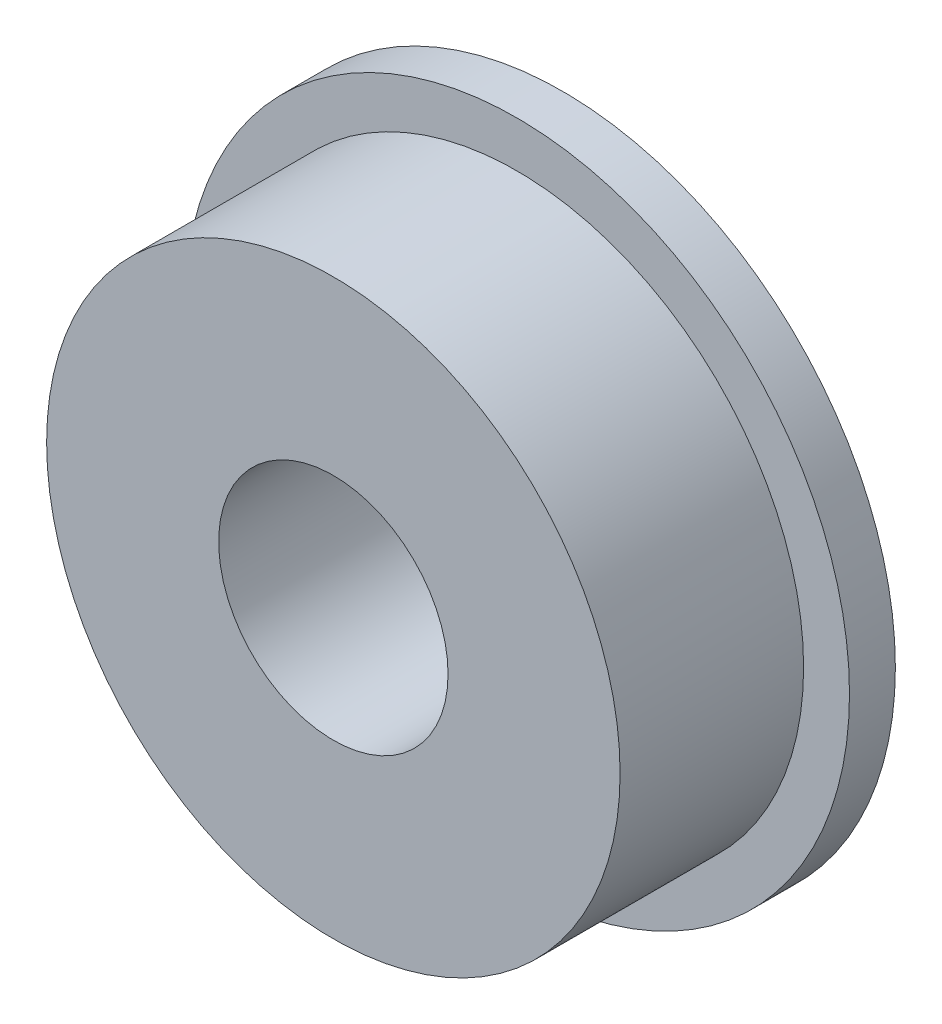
ISO-10303-21;
HEADER;
FILE_DESCRIPTION(('STEP AP214'),'2;1');
FILE_NAME('part.step','',(''),(''),'','','');
FILE_SCHEMA(('AUTOMOTIVE_DESIGN { 1 0 10303 214 1 1 1 1 }'));
ENDSEC;
DATA;
#1=APPLICATION_CONTEXT('core data for automotive mechanical design processes');
#2=APPLICATION_PROTOCOL_DEFINITION('international standard','automotive_design',2000,#1);
#3=PRODUCT_CONTEXT('',#1,'mechanical');
#4=PRODUCT('Part','Part','',(#3));
#5=PRODUCT_RELATED_PRODUCT_CATEGORY('part','',(#4));
#6=PRODUCT_DEFINITION_FORMATION('','',#4);
#7=PRODUCT_DEFINITION_CONTEXT('part definition',#1,'design');
#8=PRODUCT_DEFINITION('design','',#6,#7);
#9=PRODUCT_DEFINITION_SHAPE('','',#8);
#10=(LENGTH_UNIT() NAMED_UNIT(*) SI_UNIT(.MILLI.,.METRE.));
#11=(NAMED_UNIT(*) PLANE_ANGLE_UNIT() SI_UNIT($,.RADIAN.));
#12=(NAMED_UNIT(*) SI_UNIT($,.STERADIAN.) SOLID_ANGLE_UNIT());
#13=UNCERTAINTY_MEASURE_WITH_UNIT(LENGTH_MEASURE(1.E-05),#10,'distance_accuracy_value','');
#14=(GEOMETRIC_REPRESENTATION_CONTEXT(3) GLOBAL_UNCERTAINTY_ASSIGNED_CONTEXT((#13)) GLOBAL_UNIT_ASSIGNED_CONTEXT((#10,
#11,#12)) REPRESENTATION_CONTEXT('',''));
#15=CARTESIAN_POINT('',(0.,0.,0.));
#16=DIRECTION('',(0.,0.,1.));
#17=DIRECTION('',(1.,0.,0.));
#18=AXIS2_PLACEMENT_3D('',#15,#16,#17);
#19=CARTESIAN_POINT('',(0.,0.,4.));
#20=DIRECTION('',(0.,0.,1.));
#21=DIRECTION('',(1.,0.,0.));
#22=AXIS2_PLACEMENT_3D('',#19,#20,#21);
#23=PLANE('',#22);
#24=CARTESIAN_POINT('',(0.,0.,4.));
#25=DIRECTION('',(0.,0.,1.));
#26=DIRECTION('',(1.,0.,0.));
#27=AXIS2_PLACEMENT_3D('',#24,#25,#26);
#28=CIRCLE('',#27,2.);
#29=CARTESIAN_POINT('',(2.,0.,4.));
#30=VERTEX_POINT('',#29);
#31=EDGE_CURVE('E41',#30,#30,#28,.T.);
#32=ORIENTED_EDGE('',*,*,#31,.F.);
#33=EDGE_LOOP('',(#32));
#34=FACE_BOUND('',#33,.T.);
#35=CARTESIAN_POINT('',(0.,0.,4.));
#36=DIRECTION('',(0.,0.,1.));
#37=DIRECTION('',(1.,0.,0.));
#38=AXIS2_PLACEMENT_3D('',#35,#36,#37);
#39=CIRCLE('',#38,5.);
#40=CARTESIAN_POINT('',(5.,0.,4.));
#41=VERTEX_POINT('',#40);
#42=EDGE_CURVE('E53',#41,#41,#39,.T.);
#43=ORIENTED_EDGE('',*,*,#42,.T.);
#44=EDGE_LOOP('',(#43));
#45=FACE_BOUND('',#44,.T.);
#46=ADVANCED_FACE('F33',(#34,#45),#23,.T.);
#47=CARTESIAN_POINT('',(0.,0.,4.));
#48=DIRECTION('',(0.,0.,-1.));
#49=DIRECTION('',(-1.,0.,0.));
#50=AXIS2_PLACEMENT_3D('',#47,#48,#49);
#51=CYLINDRICAL_SURFACE('',#50,5.8);
#52=CARTESIAN_POINT('',(0.,0.,0.));
#53=DIRECTION('',(0.,0.,1.));
#54=DIRECTION('',(1.,0.,0.));
#55=AXIS2_PLACEMENT_3D('',#52,#53,#54);
#56=CIRCLE('',#55,5.8);
#57=CARTESIAN_POINT('',(5.8,0.,0.));
#58=VERTEX_POINT('',#57);
#59=EDGE_CURVE('E12',#58,#58,#56,.T.);
#60=ORIENTED_EDGE('',*,*,#59,.T.);
#61=EDGE_LOOP('',(#60));
#62=FACE_BOUND('',#61,.T.);
#63=CARTESIAN_POINT('',(0.,0.,0.8));
#64=DIRECTION('',(0.,0.,1.));
#65=DIRECTION('',(1.,0.,0.));
#66=AXIS2_PLACEMENT_3D('',#63,#64,#65);
#67=CIRCLE('',#66,5.8);
#68=CARTESIAN_POINT('',(5.8,0.,0.8));
#69=VERTEX_POINT('',#68);
#70=EDGE_CURVE('E37',#69,#69,#67,.T.);
#71=ORIENTED_EDGE('',*,*,#70,.F.);
#72=EDGE_LOOP('',(#71));
#73=FACE_BOUND('',#72,.T.);
#74=ADVANCED_FACE('F35',(#62,#73),#51,.T.);
#75=CARTESIAN_POINT('',(0.,0.,0.));
#76=DIRECTION('',(0.,0.,1.));
#77=DIRECTION('',(1.,0.,0.));
#78=AXIS2_PLACEMENT_3D('',#75,#76,#77);
#79=PLANE('',#78);
#80=ORIENTED_EDGE('',*,*,#59,.F.);
#81=EDGE_LOOP('',(#80));
#82=FACE_BOUND('',#81,.T.);
#83=CARTESIAN_POINT('',(0.,0.,0.));
#84=DIRECTION('',(0.,0.,1.));
#85=DIRECTION('',(1.,0.,0.));
#86=AXIS2_PLACEMENT_3D('',#83,#84,#85);
#87=CIRCLE('',#86,2.);
#88=CARTESIAN_POINT('',(2.,0.,0.));
#89=VERTEX_POINT('',#88);
#90=EDGE_CURVE('E45',#89,#89,#87,.T.);
#91=ORIENTED_EDGE('',*,*,#90,.T.);
#92=EDGE_LOOP('',(#91));
#93=FACE_BOUND('',#92,.T.);
#94=ADVANCED_FACE('F76',(#82,#93),#79,.F.);
#95=CARTESIAN_POINT('',(0.,0.,4.));
#96=DIRECTION('',(0.,0.,-1.));
#97=DIRECTION('',(-1.,0.,0.));
#98=AXIS2_PLACEMENT_3D('',#95,#96,#97);
#99=CYLINDRICAL_SURFACE('',#98,2.);
#100=ORIENTED_EDGE('',*,*,#31,.T.);
#101=EDGE_LOOP('',(#100));
#102=FACE_BOUND('',#101,.T.);
#103=ORIENTED_EDGE('',*,*,#90,.F.);
#104=EDGE_LOOP('',(#103));
#105=FACE_BOUND('',#104,.T.);
#106=ADVANCED_FACE('F66',(#102,#105),#99,.F.);
#107=CARTESIAN_POINT('',(0.,0.,0.8));
#108=DIRECTION('',(0.,0.,1.));
#109=DIRECTION('',(1.,0.,0.));
#110=AXIS2_PLACEMENT_3D('',#107,#108,#109);
#111=PLANE('',#110);
#112=CARTESIAN_POINT('',(0.,0.,0.799999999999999));
#113=DIRECTION('',(0.,0.,1.));
#114=DIRECTION('',(1.,0.,0.));
#115=AXIS2_PLACEMENT_3D('',#112,#113,#114);
#116=CIRCLE('',#115,5.);
#117=CARTESIAN_POINT('',(5.,0.,0.799999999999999));
#118=VERTEX_POINT('',#117);
#119=EDGE_CURVE('E50',#118,#118,#116,.F.);
#120=ORIENTED_EDGE('',*,*,#119,.T.);
#121=EDGE_LOOP('',(#120));
#122=FACE_BOUND('',#121,.T.);
#123=ORIENTED_EDGE('',*,*,#70,.T.);
#124=EDGE_LOOP('',(#123));
#125=FACE_BOUND('',#124,.T.);
#126=ADVANCED_FACE('F60',(#122,#125),#111,.T.);
#127=CARTESIAN_POINT('',(0.,0.,-17.0675669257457));
#128=DIRECTION('',(0.,0.,1.));
#129=DIRECTION('',(1.,0.,0.));
#130=AXIS2_PLACEMENT_3D('',#127,#128,#129);
#131=CYLINDRICAL_SURFACE('',#130,5.);
#132=ORIENTED_EDGE('',*,*,#119,.F.);
#133=EDGE_LOOP('',(#132));
#134=FACE_BOUND('',#133,.T.);
#135=ORIENTED_EDGE('',*,*,#42,.F.);
#136=EDGE_LOOP('',(#135));
#137=FACE_BOUND('',#136,.T.);
#138=ADVANCED_FACE('F58',(#134,#137),#131,.T.);
#139=CLOSED_SHELL('',(#46,#74,#94,#106,#126,#138));
#140=MANIFOLD_SOLID_BREP('B2',#139);
#141=ADVANCED_BREP_SHAPE_REPRESENTATION('',(#18,#140),#14);
#142=SHAPE_DEFINITION_REPRESENTATION(#9,#141);
ENDSEC;
END-ISO-10303-21;
